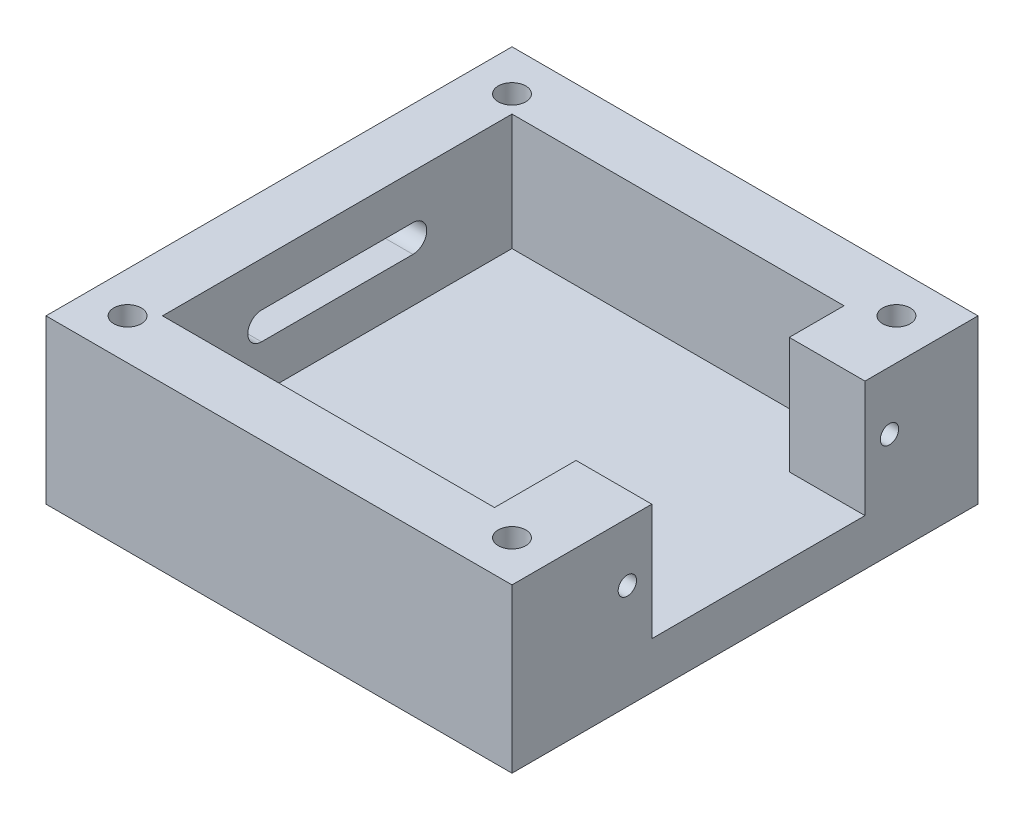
from build123d import *

# Parameters (mm, degrees)
SKETCH1_W           = 50.8
SKETCH1_H           = 50.8
BOSS_EXTRUDE1_DEPTH = 5.08
BOSS_EXTRUDE2_DEPTH = 12.7
SKETCH3_R           = 1
CUT_EXTRUDE1_DEPTH  = 53.643759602
SKETCH5_R           = 2.921
CUT_EXTRUDE2_DEPTH  = 4.445
SKETCH6_R           = 1.49987
CUT_EXTRUDE3_DEPTH  = 39.316344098
SKETCH8_R           = 4.064
CUT_EXTRUDE5_DEPTH  = 2.54
CUT_EXTRUDE6_REACH  = 61.514


with BuildPart() as part:
    # Sketch1 → Boss-Extrude1 (new body)
    with BuildSketch(Plane(origin=(0, 0, 0), x_dir=(1, 0, 0), z_dir=(0, 1, 0))):
        Rectangle(SKETCH1_W, SKETCH1_H)
    extrude(amount=BOSS_EXTRUDE1_DEPTH)

    # Sketch2 → Boss-Extrude2 (add)
    with BuildSketch(Plane(origin=(0, 5.08, 0), x_dir=(1, 0, 0), z_dir=(0, 1, 0))):
        Polygon((-25.4, -25.4), (25.4, -25.4), (25.4, -10.16), (17.145, -10.16), (17.145, -19.05), (-19.05, -19.05), (-19.05, 19.05), (17.145, 19.05), (17.145, 13.081), (25.4, 13.081), (25.4, 25.4), (-25.4, 25.4), align=None)
    extrude(amount=BOSS_EXTRUDE2_DEPTH)

    # Sketch3 → Cut-Extrude1 (cut, through all)
    with BuildSketch(Plane.ZY.offset(-17.145)):
        with Locations((12.827, 11.43)):
            Circle(SKETCH3_R)
        with Locations((-15.748, 11.43)):
            Circle(SKETCH3_R)
    extrude(amount=-CUT_EXTRUDE1_DEPTH, mode=Mode.SUBTRACT)

    # Sketch5 → Cut-Extrude2 (cut)
    with BuildSketch(Plane.XZ):
        with Locations(Location((-20.955, 20.955, 0), (0, 0, 270))):
            Circle(SKETCH5_R)
        with Locations(Location((-20.955, -20.955, 0), (0, 0, 270))):
            Circle(SKETCH5_R)
        with Locations(Location((20.955, -20.955, 0), (0, 0, 270))):
            Circle(SKETCH5_R)
        with Locations(Location((20.955, 20.955, 0), (0, 0, 270))):
            Circle(SKETCH5_R)
    extrude(amount=-CUT_EXTRUDE2_DEPTH, mode=Mode.SUBTRACT)

    # Sketch6 → Cut-Extrude3 (cut, through all)
    with BuildSketch(Plane.XZ.offset(-4.445)):
        with Locations(Location((-20.955, 20.955, 0), (0, 0, 270))):
            Circle(SKETCH6_R)
        with Locations(Location((20.955, 20.955, 0), (0, 0, 270))):
            Circle(SKETCH6_R)
        with Locations(Location((20.955, -20.955, 0), (0, 0, 270))):
            Circle(SKETCH6_R)
        with Locations(Location((-20.955, -20.955, 0), (0, 0, 270))):
            Circle(SKETCH6_R)
    extrude(amount=-CUT_EXTRUDE3_DEPTH, mode=Mode.SUBTRACT)

    # Sketch8 → Cut-Extrude5 (cut)
    with BuildSketch(Plane.XZ):
        with Locations(Location((0, 0, 0), (0, 0, 270))):
            Circle(SKETCH8_R)
    extrude(amount=-CUT_EXTRUDE5_DEPTH, mode=Mode.SUBTRACT)

    # Sketch9 → Cut-Extrude6 (cut, up to next)
    with BuildSketch(Plane.ZY.offset(25.4), mode=Mode.PRIVATE) as cut_extrude6_sk1:
        with BuildLine():
            Line((8.255, 9.93), (-8.255, 9.93))
            ThreePointArc((-8.255, 9.93), (-9.755, 11.43), (-8.255, 12.93))
            Line((-8.255, 12.93), (8.255, 12.93))
            ThreePointArc((8.255, 12.93), (9.755, 11.43), (8.255, 9.93))
        make_face()
    cut_extrude6_tool1 = extrude(cut_extrude6_sk1.sketch, amount=-CUT_EXTRUDE6_REACH, mode=Mode.PRIVATE) & part.part
    add(cut_extrude6_tool1.solids().sort_by_distance((-25.4, 11.43, 0))[0], mode=Mode.SUBTRACT)


solid = part.part
